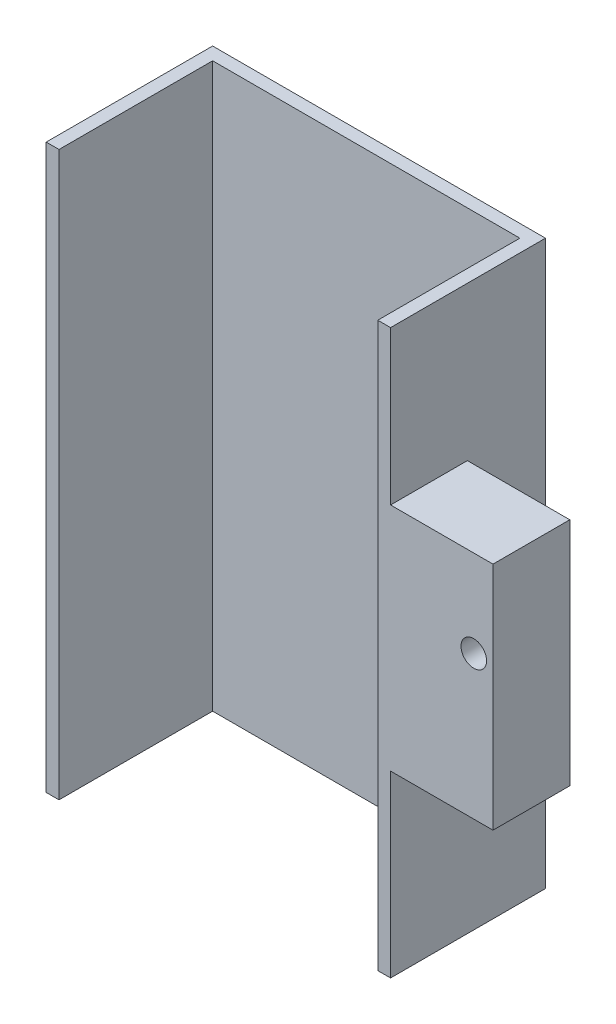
ISO-10303-21;
HEADER;
FILE_DESCRIPTION(('STEP AP214'),'2;1');
FILE_NAME('part.step','',(''),(''),'','','');
FILE_SCHEMA(('AUTOMOTIVE_DESIGN { 1 0 10303 214 1 1 1 1 }'));
ENDSEC;
DATA;
#1=APPLICATION_CONTEXT('core data for automotive mechanical design processes');
#2=APPLICATION_PROTOCOL_DEFINITION('international standard','automotive_design',2000,#1);
#3=PRODUCT_CONTEXT('',#1,'mechanical');
#4=PRODUCT('Part','Part','',(#3));
#5=PRODUCT_RELATED_PRODUCT_CATEGORY('part','',(#4));
#6=PRODUCT_DEFINITION_FORMATION('','',#4);
#7=PRODUCT_DEFINITION_CONTEXT('part definition',#1,'design');
#8=PRODUCT_DEFINITION('design','',#6,#7);
#9=PRODUCT_DEFINITION_SHAPE('','',#8);
#10=(LENGTH_UNIT() NAMED_UNIT(*) SI_UNIT(.MILLI.,.METRE.));
#11=(NAMED_UNIT(*) PLANE_ANGLE_UNIT() SI_UNIT($,.RADIAN.));
#12=(NAMED_UNIT(*) SI_UNIT($,.STERADIAN.) SOLID_ANGLE_UNIT());
#13=UNCERTAINTY_MEASURE_WITH_UNIT(LENGTH_MEASURE(1.E-05),#10,'distance_accuracy_value','');
#14=(GEOMETRIC_REPRESENTATION_CONTEXT(3) GLOBAL_UNCERTAINTY_ASSIGNED_CONTEXT((#13)) GLOBAL_UNIT_ASSIGNED_CONTEXT((#10,
#11,#12)) REPRESENTATION_CONTEXT('',''));
#15=CARTESIAN_POINT('',(0.,0.,0.));
#16=DIRECTION('',(0.,0.,1.));
#17=DIRECTION('',(1.,0.,0.));
#18=AXIS2_PLACEMENT_3D('',#15,#16,#17);
#19=CARTESIAN_POINT('',(61.,440.,-130.));
#20=DIRECTION('',(-1.,0.,0.));
#21=DIRECTION('',(0.,0.,1.));
#22=AXIS2_PLACEMENT_3D('',#19,#20,#21);
#23=PLANE('',#22);
#24=DIRECTION('',(0.,0.,-1.));
#25=VECTOR('',#24,1.);
#26=CARTESIAN_POINT('',(61.,440.,-130.));
#27=LINE('',#26,#25);
#28=CARTESIAN_POINT('',(61.,440.,-9.00000000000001));
#29=VERTEX_POINT('',#28);
#30=CARTESIAN_POINT('',(61.,440.,-130.));
#31=VERTEX_POINT('',#30);
#32=EDGE_CURVE('E161',#29,#31,#27,.T.);
#33=ORIENTED_EDGE('',*,*,#32,.F.);
#34=DIRECTION('',(0.,1.,0.));
#35=VECTOR('',#34,1.);
#36=CARTESIAN_POINT('',(61.,453.790691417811,-9.00000000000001));
#37=LINE('',#36,#35);
#38=CARTESIAN_POINT('',(61.,320.,-9.00000000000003));
#39=VERTEX_POINT('',#38);
#40=EDGE_CURVE('E136',#39,#29,#37,.T.);
#41=ORIENTED_EDGE('',*,*,#40,.F.);
#42=DIRECTION('',(0.,0.,1.));
#43=VECTOR('',#42,1.);
#44=CARTESIAN_POINT('',(61.,320.,-9.00000000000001));
#45=LINE('',#44,#43);
#46=CARTESIAN_POINT('',(61.,320.,-69.));
#47=VERTEX_POINT('',#46);
#48=EDGE_CURVE('E220',#47,#39,#45,.T.);
#49=ORIENTED_EDGE('',*,*,#48,.F.);
#50=DIRECTION('',(0.,1.,0.));
#51=VECTOR('',#50,1.);
#52=CARTESIAN_POINT('',(61.,320.,-69.));
#53=LINE('',#52,#51);
#54=CARTESIAN_POINT('',(61.,140.,-69.));
#55=VERTEX_POINT('',#54);
#56=EDGE_CURVE('E56',#55,#47,#53,.T.);
#57=ORIENTED_EDGE('',*,*,#56,.F.);
#58=DIRECTION('',(0.,0.,-1.));
#59=VECTOR('',#58,1.);
#60=CARTESIAN_POINT('',(61.,140.,-9.00000000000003));
#61=LINE('',#60,#59);
#62=CARTESIAN_POINT('',(61.,140.,-9.00000000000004));
#63=VERTEX_POINT('',#62);
#64=EDGE_CURVE('E134',#63,#55,#61,.T.);
#65=ORIENTED_EDGE('',*,*,#64,.F.);
#66=CARTESIAN_POINT('',(61.,0.,-9.00000000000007));
#67=VERTEX_POINT('',#66);
#68=EDGE_CURVE('E49',#67,#63,#37,.T.);
#69=ORIENTED_EDGE('',*,*,#68,.F.);
#70=DIRECTION('',(0.,0.,-1.));
#71=VECTOR('',#70,1.);
#72=CARTESIAN_POINT('',(61.,0.,-130.));
#73=LINE('',#72,#71);
#74=CARTESIAN_POINT('',(61.,0.,-130.));
#75=VERTEX_POINT('',#74);
#76=EDGE_CURVE('E132',#67,#75,#73,.T.);
#77=ORIENTED_EDGE('',*,*,#76,.T.);
#78=DIRECTION('',(0.,-1.,0.));
#79=VECTOR('',#78,1.);
#80=CARTESIAN_POINT('',(61.,440.,-130.));
#81=LINE('',#80,#79);
#82=EDGE_CURVE('E178',#31,#75,#81,.T.);
#83=ORIENTED_EDGE('',*,*,#82,.F.);
#84=EDGE_LOOP('',(#33,#41,#49,#57,#65,#69,#77,#83));
#85=FACE_BOUND('',#84,.T.);
#86=ADVANCED_FACE('F33',(#85),#23,.F.);
#87=CARTESIAN_POINT('',(-189.,440.,-120.));
#88=DIRECTION('',(-1.,0.,0.));
#89=DIRECTION('',(0.,0.,1.));
#90=AXIS2_PLACEMENT_3D('',#87,#88,#89);
#91=PLANE('',#90);
#92=DIRECTION('',(0.,0.,-1.));
#93=VECTOR('',#92,1.);
#94=CARTESIAN_POINT('',(-189.,0.,-120.));
#95=LINE('',#94,#93);
#96=CARTESIAN_POINT('',(-189.,0.,0.));
#97=VERTEX_POINT('',#96);
#98=CARTESIAN_POINT('',(-189.,0.,-120.));
#99=VERTEX_POINT('',#98);
#100=EDGE_CURVE('E195',#97,#99,#95,.T.);
#101=ORIENTED_EDGE('',*,*,#100,.T.);
#102=DIRECTION('',(0.,-1.,0.));
#103=VECTOR('',#102,1.);
#104=CARTESIAN_POINT('',(-189.,440.,-120.));
#105=LINE('',#104,#103);
#106=CARTESIAN_POINT('',(-189.,440.,-120.));
#107=VERTEX_POINT('',#106);
#108=EDGE_CURVE('E42',#107,#99,#105,.T.);
#109=ORIENTED_EDGE('',*,*,#108,.F.);
#110=DIRECTION('',(0.,0.,-1.));
#111=VECTOR('',#110,1.);
#112=CARTESIAN_POINT('',(-189.,440.,-120.));
#113=LINE('',#112,#111);
#114=CARTESIAN_POINT('',(-189.,440.,0.));
#115=VERTEX_POINT('',#114);
#116=EDGE_CURVE('E153',#115,#107,#113,.T.);
#117=ORIENTED_EDGE('',*,*,#116,.F.);
#118=DIRECTION('',(0.,-1.,0.));
#119=VECTOR('',#118,1.);
#120=CARTESIAN_POINT('',(-189.,440.,0.));
#121=LINE('',#120,#119);
#122=EDGE_CURVE('E169',#115,#97,#121,.T.);
#123=ORIENTED_EDGE('',*,*,#122,.T.);
#124=EDGE_LOOP('',(#101,#109,#117,#123));
#125=FACE_BOUND('',#124,.T.);
#126=ADVANCED_FACE('F35',(#125),#91,.F.);
#127=CARTESIAN_POINT('',(-189.,440.,-120.));
#128=DIRECTION('',(0.,0.,-1.));
#129=DIRECTION('',(-1.,0.,0.));
#130=AXIS2_PLACEMENT_3D('',#127,#128,#129);
#131=PLANE('',#130);
#132=DIRECTION('',(1.,0.,0.));
#133=VECTOR('',#132,1.);
#134=CARTESIAN_POINT('',(-189.,0.,-120.));
#135=LINE('',#134,#133);
#136=CARTESIAN_POINT('',(51.,0.,-120.));
#137=VERTEX_POINT('',#136);
#138=EDGE_CURVE('E146',#99,#137,#135,.T.);
#139=ORIENTED_EDGE('',*,*,#138,.T.);
#140=DIRECTION('',(0.,-1.,0.));
#141=VECTOR('',#140,1.);
#142=CARTESIAN_POINT('',(51.,440.,-120.));
#143=LINE('',#142,#141);
#144=CARTESIAN_POINT('',(51.,440.,-120.));
#145=VERTEX_POINT('',#144);
#146=EDGE_CURVE('E180',#145,#137,#143,.T.);
#147=ORIENTED_EDGE('',*,*,#146,.F.);
#148=DIRECTION('',(1.,0.,0.));
#149=VECTOR('',#148,1.);
#150=CARTESIAN_POINT('',(-189.,440.,-120.));
#151=LINE('',#150,#149);
#152=EDGE_CURVE('E156',#107,#145,#151,.T.);
#153=ORIENTED_EDGE('',*,*,#152,.F.);
#154=ORIENTED_EDGE('',*,*,#108,.T.);
#155=EDGE_LOOP('',(#139,#147,#153,#154));
#156=FACE_BOUND('',#155,.T.);
#157=ADVANCED_FACE('F190',(#156),#131,.F.);
#158=CARTESIAN_POINT('',(51.,440.,-120.));
#159=DIRECTION('',(1.,0.,0.));
#160=DIRECTION('',(0.,0.,-1.));
#161=AXIS2_PLACEMENT_3D('',#158,#159,#160);
#162=PLANE('',#161);
#163=DIRECTION('',(0.,0.,1.));
#164=VECTOR('',#163,1.);
#165=CARTESIAN_POINT('',(51.,0.,-120.));
#166=LINE('',#165,#164);
#167=CARTESIAN_POINT('',(51.,0.,-9.00000000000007));
#168=VERTEX_POINT('',#167);
#169=EDGE_CURVE('E142',#137,#168,#166,.T.);
#170=ORIENTED_EDGE('',*,*,#169,.T.);
#171=DIRECTION('',(0.,1.,0.));
#172=VECTOR('',#171,1.);
#173=CARTESIAN_POINT('',(51.,440.,-9.00000000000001));
#174=LINE('',#173,#172);
#175=CARTESIAN_POINT('',(51.,440.,-9.00000000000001));
#176=VERTEX_POINT('',#175);
#177=EDGE_CURVE('E125',#168,#176,#174,.T.);
#178=ORIENTED_EDGE('',*,*,#177,.T.);
#179=DIRECTION('',(0.,0.,1.));
#180=VECTOR('',#179,1.);
#181=CARTESIAN_POINT('',(51.,440.,-120.));
#182=LINE('',#181,#180);
#183=EDGE_CURVE('E158',#145,#176,#182,.T.);
#184=ORIENTED_EDGE('',*,*,#183,.F.);
#185=ORIENTED_EDGE('',*,*,#146,.T.);
#186=EDGE_LOOP('',(#170,#178,#184,#185));
#187=FACE_BOUND('',#186,.T.);
#188=ADVANCED_FACE('F257',(#187),#162,.F.);
#189=CARTESIAN_POINT('',(-199.,440.,-130.));
#190=DIRECTION('',(0.,0.,1.));
#191=DIRECTION('',(1.,0.,0.));
#192=AXIS2_PLACEMENT_3D('',#189,#190,#191);
#193=PLANE('',#192);
#194=DIRECTION('',(-1.,0.,0.));
#195=VECTOR('',#194,1.);
#196=CARTESIAN_POINT('',(-199.,0.,-130.));
#197=LINE('',#196,#195);
#198=CARTESIAN_POINT('',(-199.,0.,-130.));
#199=VERTEX_POINT('',#198);
#200=EDGE_CURVE('E141',#75,#199,#197,.T.);
#201=ORIENTED_EDGE('',*,*,#200,.T.);
#202=DIRECTION('',(0.,-1.,0.));
#203=VECTOR('',#202,1.);
#204=CARTESIAN_POINT('',(-199.,440.,-130.));
#205=LINE('',#204,#203);
#206=CARTESIAN_POINT('',(-199.,440.,-130.));
#207=VERTEX_POINT('',#206);
#208=EDGE_CURVE('E175',#207,#199,#205,.T.);
#209=ORIENTED_EDGE('',*,*,#208,.F.);
#210=DIRECTION('',(-1.,0.,0.));
#211=VECTOR('',#210,1.);
#212=CARTESIAN_POINT('',(-199.,440.,-130.));
#213=LINE('',#212,#211);
#214=EDGE_CURVE('E163',#31,#207,#213,.T.);
#215=ORIENTED_EDGE('',*,*,#214,.F.);
#216=ORIENTED_EDGE('',*,*,#82,.T.);
#217=EDGE_LOOP('',(#201,#209,#215,#216));
#218=FACE_BOUND('',#217,.T.);
#219=ADVANCED_FACE('F255',(#218),#193,.F.);
#220=CARTESIAN_POINT('',(-199.,440.,-130.));
#221=DIRECTION('',(1.,0.,0.));
#222=DIRECTION('',(0.,0.,-1.));
#223=AXIS2_PLACEMENT_3D('',#220,#221,#222);
#224=PLANE('',#223);
#225=DIRECTION('',(0.,0.,1.));
#226=VECTOR('',#225,1.);
#227=CARTESIAN_POINT('',(-199.,0.,-130.));
#228=LINE('',#227,#226);
#229=CARTESIAN_POINT('',(-199.,0.,0.));
#230=VERTEX_POINT('',#229);
#231=EDGE_CURVE('E144',#199,#230,#228,.T.);
#232=ORIENTED_EDGE('',*,*,#231,.T.);
#233=DIRECTION('',(0.,-1.,0.));
#234=VECTOR('',#233,1.);
#235=CARTESIAN_POINT('',(-199.,440.,0.));
#236=LINE('',#235,#234);
#237=CARTESIAN_POINT('',(-199.,440.,0.));
#238=VERTEX_POINT('',#237);
#239=EDGE_CURVE('E172',#238,#230,#236,.T.);
#240=ORIENTED_EDGE('',*,*,#239,.F.);
#241=DIRECTION('',(0.,0.,1.));
#242=VECTOR('',#241,1.);
#243=CARTESIAN_POINT('',(-199.,440.,-130.));
#244=LINE('',#243,#242);
#245=EDGE_CURVE('E165',#207,#238,#244,.T.);
#246=ORIENTED_EDGE('',*,*,#245,.F.);
#247=ORIENTED_EDGE('',*,*,#208,.T.);
#248=EDGE_LOOP('',(#232,#240,#246,#247));
#249=FACE_BOUND('',#248,.T.);
#250=ADVANCED_FACE('F276',(#249),#224,.F.);
#251=CARTESIAN_POINT('',(-199.,440.,0.));
#252=DIRECTION('',(0.,0.,-1.));
#253=DIRECTION('',(-1.,0.,0.));
#254=AXIS2_PLACEMENT_3D('',#251,#252,#253);
#255=PLANE('',#254);
#256=DIRECTION('',(1.,0.,0.));
#257=VECTOR('',#256,1.);
#258=CARTESIAN_POINT('',(-199.,0.,0.));
#259=LINE('',#258,#257);
#260=EDGE_CURVE('E151',#230,#97,#259,.T.);
#261=ORIENTED_EDGE('',*,*,#260,.T.);
#262=ORIENTED_EDGE('',*,*,#122,.F.);
#263=DIRECTION('',(1.,0.,0.));
#264=VECTOR('',#263,1.);
#265=CARTESIAN_POINT('',(-199.,440.,0.));
#266=LINE('',#265,#264);
#267=EDGE_CURVE('E167',#238,#115,#266,.T.);
#268=ORIENTED_EDGE('',*,*,#267,.F.);
#269=ORIENTED_EDGE('',*,*,#239,.T.);
#270=EDGE_LOOP('',(#261,#262,#268,#269));
#271=FACE_BOUND('',#270,.T.);
#272=ADVANCED_FACE('F283',(#271),#255,.F.);
#273=CARTESIAN_POINT('',(-189.,440.,0.));
#274=DIRECTION('',(0.,1.,0.));
#275=DIRECTION('',(0.,0.,1.));
#276=AXIS2_PLACEMENT_3D('',#273,#274,#275);
#277=PLANE('',#276);
#278=DIRECTION('',(-1.,0.,0.));
#279=VECTOR('',#278,1.);
#280=CARTESIAN_POINT('',(-189.,440.,-9.));
#281=LINE('',#280,#279);
#282=EDGE_CURVE('E225',#29,#176,#281,.T.);
#283=ORIENTED_EDGE('',*,*,#282,.F.);
#284=ORIENTED_EDGE('',*,*,#32,.T.);
#285=ORIENTED_EDGE('',*,*,#214,.T.);
#286=ORIENTED_EDGE('',*,*,#245,.T.);
#287=ORIENTED_EDGE('',*,*,#267,.T.);
#288=ORIENTED_EDGE('',*,*,#116,.T.);
#289=ORIENTED_EDGE('',*,*,#152,.T.);
#290=ORIENTED_EDGE('',*,*,#183,.T.);
#291=EDGE_LOOP('',(#283,#284,#285,#286,#287,#288,#289,#290));
#292=FACE_BOUND('',#291,.T.);
#293=ADVANCED_FACE('F290',(#292),#277,.T.);
#294=CARTESIAN_POINT('',(-189.,0.,0.));
#295=DIRECTION('',(0.,1.,0.));
#296=DIRECTION('',(0.,0.,1.));
#297=AXIS2_PLACEMENT_3D('',#294,#295,#296);
#298=PLANE('',#297);
#299=ORIENTED_EDGE('',*,*,#76,.F.);
#300=DIRECTION('',(-1.,0.,0.));
#301=VECTOR('',#300,1.);
#302=CARTESIAN_POINT('',(-189.,0.,-9.00000000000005));
#303=LINE('',#302,#301);
#304=EDGE_CURVE('E11',#67,#168,#303,.T.);
#305=ORIENTED_EDGE('',*,*,#304,.T.);
#306=ORIENTED_EDGE('',*,*,#169,.F.);
#307=ORIENTED_EDGE('',*,*,#138,.F.);
#308=ORIENTED_EDGE('',*,*,#100,.F.);
#309=ORIENTED_EDGE('',*,*,#260,.F.);
#310=ORIENTED_EDGE('',*,*,#231,.F.);
#311=ORIENTED_EDGE('',*,*,#200,.F.);
#312=EDGE_LOOP('',(#299,#305,#306,#307,#308,#309,#310,#311));
#313=FACE_BOUND('',#312,.T.);
#314=ADVANCED_FACE('F139',(#313),#298,.F.);
#315=CARTESIAN_POINT('',(141.,320.,-9.00000000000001));
#316=DIRECTION('',(0.,0.,-1.));
#317=DIRECTION('',(0.,1.,0.));
#318=AXIS2_PLACEMENT_3D('',#315,#316,#317);
#319=PLANE('',#318);
#320=CARTESIAN_POINT('',(126.,252.03,-9.00000000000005));
#321=DIRECTION('',(0.,0.,1.));
#322=DIRECTION('',(1.,0.,0.));
#323=AXIS2_PLACEMENT_3D('',#320,#321,#322);
#324=CIRCLE('',#323,10.);
#325=CARTESIAN_POINT('',(136.,252.03,-9.00000000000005));
#326=VERTEX_POINT('',#325);
#327=EDGE_CURVE('E228',#326,#326,#324,.T.);
#328=ORIENTED_EDGE('',*,*,#327,.F.);
#329=EDGE_LOOP('',(#328));
#330=FACE_BOUND('',#329,.T.);
#331=DIRECTION('',(-1.,0.,0.));
#332=VECTOR('',#331,1.);
#333=CARTESIAN_POINT('',(141.,320.,-9.00000000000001));
#334=LINE('',#333,#332);
#335=CARTESIAN_POINT('',(141.,320.,-9.00000000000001));
#336=VERTEX_POINT('',#335);
#337=EDGE_CURVE('E208',#336,#39,#334,.T.);
#338=ORIENTED_EDGE('',*,*,#337,.T.);
#339=ORIENTED_EDGE('',*,*,#40,.T.);
#340=ORIENTED_EDGE('',*,*,#282,.T.);
#341=ORIENTED_EDGE('',*,*,#177,.F.);
#342=ORIENTED_EDGE('',*,*,#304,.F.);
#343=ORIENTED_EDGE('',*,*,#68,.T.);
#344=DIRECTION('',(-1.,0.,0.));
#345=VECTOR('',#344,1.);
#346=CARTESIAN_POINT('',(141.,140.,-9.00000000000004));
#347=LINE('',#346,#345);
#348=CARTESIAN_POINT('',(141.,140.,-9.00000000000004));
#349=VERTEX_POINT('',#348);
#350=EDGE_CURVE('E198',#349,#63,#347,.T.);
#351=ORIENTED_EDGE('',*,*,#350,.F.);
#352=DIRECTION('',(0.,-1.,0.));
#353=VECTOR('',#352,1.);
#354=CARTESIAN_POINT('',(141.,320.,-9.00000000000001));
#355=LINE('',#354,#353);
#356=EDGE_CURVE('E217',#336,#349,#355,.T.);
#357=ORIENTED_EDGE('',*,*,#356,.F.);
#358=EDGE_LOOP('',(#338,#339,#340,#341,#342,#343,#351,#357));
#359=FACE_BOUND('',#358,.T.);
#360=ADVANCED_FACE('F123',(#330,#359),#319,.F.);
#361=CARTESIAN_POINT('',(141.,140.,-9.00000000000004));
#362=DIRECTION('',(0.,1.,0.));
#363=DIRECTION('',(0.,0.,1.));
#364=AXIS2_PLACEMENT_3D('',#361,#362,#363);
#365=PLANE('',#364);
#366=ORIENTED_EDGE('',*,*,#64,.T.);
#367=DIRECTION('',(-1.,0.,0.));
#368=VECTOR('',#367,1.);
#369=CARTESIAN_POINT('',(141.,140.,-69.));
#370=LINE('',#369,#368);
#371=CARTESIAN_POINT('',(141.,140.,-69.));
#372=VERTEX_POINT('',#371);
#373=EDGE_CURVE('E200',#372,#55,#370,.T.);
#374=ORIENTED_EDGE('',*,*,#373,.F.);
#375=DIRECTION('',(0.,0.,-1.));
#376=VECTOR('',#375,1.);
#377=CARTESIAN_POINT('',(141.,140.,-9.00000000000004));
#378=LINE('',#377,#376);
#379=EDGE_CURVE('E215',#349,#372,#378,.T.);
#380=ORIENTED_EDGE('',*,*,#379,.F.);
#381=ORIENTED_EDGE('',*,*,#350,.T.);
#382=EDGE_LOOP('',(#366,#374,#380,#381));
#383=FACE_BOUND('',#382,.T.);
#384=ADVANCED_FACE('F312',(#383),#365,.F.);
#385=CARTESIAN_POINT('',(141.,320.,-69.));
#386=DIRECTION('',(0.,0.,1.));
#387=DIRECTION('',(0.,-1.,0.));
#388=AXIS2_PLACEMENT_3D('',#385,#386,#387);
#389=PLANE('',#388);
#390=CARTESIAN_POINT('',(126.,252.03,-69.));
#391=DIRECTION('',(0.,0.,1.));
#392=DIRECTION('',(0.,-1.,0.));
#393=AXIS2_PLACEMENT_3D('',#390,#391,#392);
#394=CIRCLE('',#393,10.);
#395=CARTESIAN_POINT('',(126.,242.03,-69.));
#396=VERTEX_POINT('',#395);
#397=EDGE_CURVE('E37',#396,#396,#394,.T.);
#398=ORIENTED_EDGE('',*,*,#397,.T.);
#399=EDGE_LOOP('',(#398));
#400=FACE_BOUND('',#399,.T.);
#401=ORIENTED_EDGE('',*,*,#56,.T.);
#402=DIRECTION('',(-1.,0.,0.));
#403=VECTOR('',#402,1.);
#404=CARTESIAN_POINT('',(141.,320.,-69.));
#405=LINE('',#404,#403);
#406=CARTESIAN_POINT('',(141.,320.,-69.));
#407=VERTEX_POINT('',#406);
#408=EDGE_CURVE('E205',#407,#47,#405,.T.);
#409=ORIENTED_EDGE('',*,*,#408,.F.);
#410=DIRECTION('',(0.,1.,0.));
#411=VECTOR('',#410,1.);
#412=CARTESIAN_POINT('',(141.,320.,-69.));
#413=LINE('',#412,#411);
#414=EDGE_CURVE('E213',#372,#407,#413,.T.);
#415=ORIENTED_EDGE('',*,*,#414,.F.);
#416=ORIENTED_EDGE('',*,*,#373,.T.);
#417=EDGE_LOOP('',(#401,#409,#415,#416));
#418=FACE_BOUND('',#417,.T.);
#419=ADVANCED_FACE('F235',(#400,#418),#389,.F.);
#420=CARTESIAN_POINT('',(141.,320.,-9.00000000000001));
#421=DIRECTION('',(0.,-1.,0.));
#422=DIRECTION('',(0.,0.,-1.));
#423=AXIS2_PLACEMENT_3D('',#420,#421,#422);
#424=PLANE('',#423);
#425=ORIENTED_EDGE('',*,*,#48,.T.);
#426=ORIENTED_EDGE('',*,*,#337,.F.);
#427=DIRECTION('',(0.,0.,1.));
#428=VECTOR('',#427,1.);
#429=CARTESIAN_POINT('',(141.,320.,-9.00000000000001));
#430=LINE('',#429,#428);
#431=EDGE_CURVE('E211',#407,#336,#430,.T.);
#432=ORIENTED_EDGE('',*,*,#431,.F.);
#433=ORIENTED_EDGE('',*,*,#408,.T.);
#434=EDGE_LOOP('',(#425,#426,#432,#433));
#435=FACE_BOUND('',#434,.T.);
#436=ADVANCED_FACE('F245',(#435),#424,.F.);
#437=CARTESIAN_POINT('',(141.,140.,-9.00000000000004));
#438=DIRECTION('',(1.,0.,0.));
#439=DIRECTION('',(0.,0.,-1.));
#440=AXIS2_PLACEMENT_3D('',#437,#438,#439);
#441=PLANE('',#440);
#442=ORIENTED_EDGE('',*,*,#356,.T.);
#443=ORIENTED_EDGE('',*,*,#379,.T.);
#444=ORIENTED_EDGE('',*,*,#414,.T.);
#445=ORIENTED_EDGE('',*,*,#431,.T.);
#446=EDGE_LOOP('',(#442,#443,#444,#445));
#447=FACE_BOUND('',#446,.T.);
#448=ADVANCED_FACE('F240',(#447),#441,.T.);
#449=CARTESIAN_POINT('',(126.,252.03,-130.));
#450=DIRECTION('',(0.,0.,1.));
#451=DIRECTION('',(1.,0.,0.));
#452=AXIS2_PLACEMENT_3D('',#449,#450,#451);
#453=CYLINDRICAL_SURFACE('',#452,10.);
#454=ORIENTED_EDGE('',*,*,#327,.T.);
#455=EDGE_LOOP('',(#454));
#456=FACE_BOUND('',#455,.T.);
#457=ORIENTED_EDGE('',*,*,#397,.F.);
#458=EDGE_LOOP('',(#457));
#459=FACE_BOUND('',#458,.T.);
#460=ADVANCED_FACE('F238',(#456,#459),#453,.F.);
#461=CLOSED_SHELL('',(#86,#126,#157,#188,#219,#250,#272,#293,#314,#360,#384,#419,#436,#448,#460));
#462=MANIFOLD_SOLID_BREP('B2',#461);
#463=ADVANCED_BREP_SHAPE_REPRESENTATION('',(#18,#462),#14);
#464=SHAPE_DEFINITION_REPRESENTATION(#9,#463);
ENDSEC;
END-ISO-10303-21;
